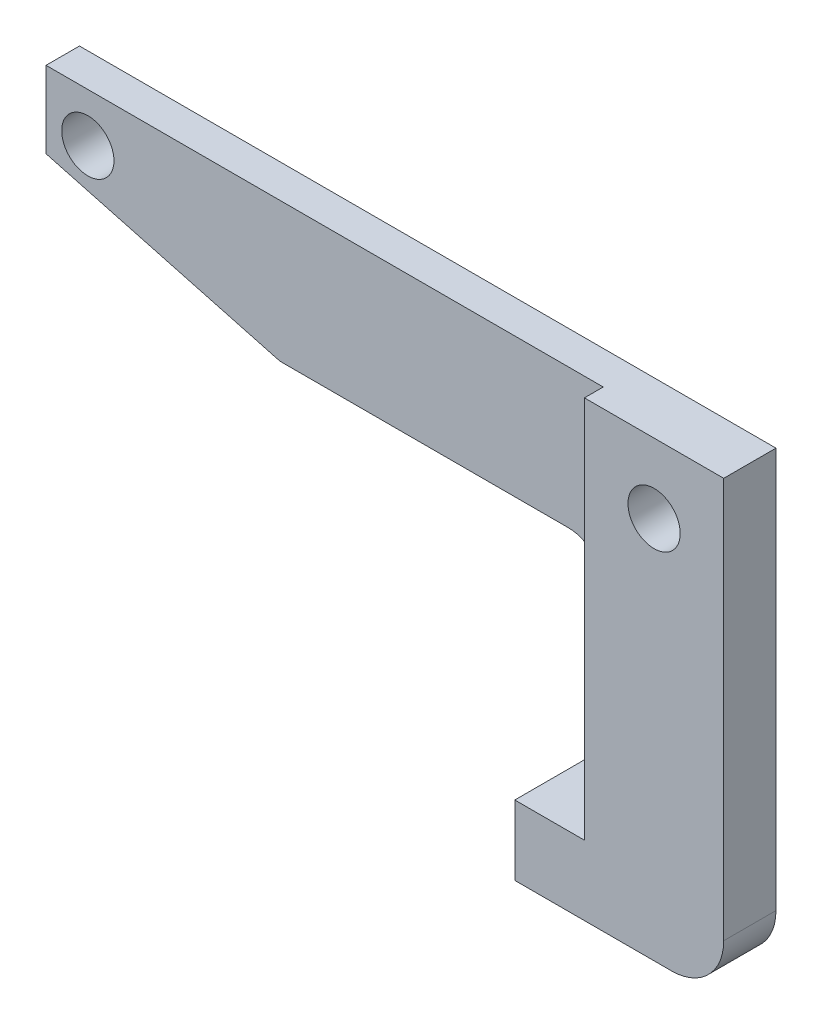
ISO-10303-21;
HEADER;
FILE_DESCRIPTION(('STEP AP214'),'2;1');
FILE_NAME('part.step','',(''),(''),'','','');
FILE_SCHEMA(('AUTOMOTIVE_DESIGN { 1 0 10303 214 1 1 1 1 }'));
ENDSEC;
DATA;
#1=APPLICATION_CONTEXT('core data for automotive mechanical design processes');
#2=APPLICATION_PROTOCOL_DEFINITION('international standard','automotive_design',2000,#1);
#3=PRODUCT_CONTEXT('',#1,'mechanical');
#4=PRODUCT('Part','Part','',(#3));
#5=PRODUCT_RELATED_PRODUCT_CATEGORY('part','',(#4));
#6=PRODUCT_DEFINITION_FORMATION('','',#4);
#7=PRODUCT_DEFINITION_CONTEXT('part definition',#1,'design');
#8=PRODUCT_DEFINITION('design','',#6,#7);
#9=PRODUCT_DEFINITION_SHAPE('','',#8);
#10=(LENGTH_UNIT() NAMED_UNIT(*) SI_UNIT(.MILLI.,.METRE.));
#11=(NAMED_UNIT(*) PLANE_ANGLE_UNIT() SI_UNIT($,.RADIAN.));
#12=(NAMED_UNIT(*) SI_UNIT($,.STERADIAN.) SOLID_ANGLE_UNIT());
#13=UNCERTAINTY_MEASURE_WITH_UNIT(LENGTH_MEASURE(1.E-05),#10,'distance_accuracy_value','');
#14=(GEOMETRIC_REPRESENTATION_CONTEXT(3) GLOBAL_UNCERTAINTY_ASSIGNED_CONTEXT((#13)) GLOBAL_UNIT_ASSIGNED_CONTEXT((#10,
#11,#12)) REPRESENTATION_CONTEXT('',''));
#15=CARTESIAN_POINT('',(0.,0.,0.));
#16=DIRECTION('',(0.,0.,1.));
#17=DIRECTION('',(1.,0.,0.));
#18=AXIS2_PLACEMENT_3D('',#15,#16,#17);
#19=CARTESIAN_POINT('',(12.7,-12.7,0.));
#20=DIRECTION('',(0.,0.,-1.));
#21=DIRECTION('',(-1.,0.,0.));
#22=AXIS2_PLACEMENT_3D('',#19,#20,#21);
#23=PLANE('',#22);
#24=CARTESIAN_POINT('',(0.,0.,0.));
#25=DIRECTION('',(0.,0.,-1.));
#26=DIRECTION('',(-1.,0.,0.));
#27=AXIS2_PLACEMENT_3D('',#24,#25,#26);
#28=CIRCLE('',#27,9.525);
#29=CARTESIAN_POINT('',(0.,9.52499999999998,0.));
#30=VERTEX_POINT('',#29);
#31=CARTESIAN_POINT('',(9.52499999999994,0.,0.));
#32=VERTEX_POINT('',#31);
#33=EDGE_CURVE('E49',#30,#32,#28,.T.);
#34=ORIENTED_EDGE('',*,*,#33,.F.);
#35=DIRECTION('',(1.,0.,0.));
#36=VECTOR('',#35,1.);
#37=CARTESIAN_POINT('',(9.52499999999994,9.52499999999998,0.));
#38=LINE('',#37,#36);
#39=CARTESIAN_POINT('',(9.52499999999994,9.52499999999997,0.));
#40=VERTEX_POINT('',#39);
#41=EDGE_CURVE('E150',#30,#40,#38,.T.);
#42=ORIENTED_EDGE('',*,*,#41,.T.);
#43=DIRECTION('',(0.,-1.,0.));
#44=VECTOR('',#43,1.);
#45=CARTESIAN_POINT('',(9.52499999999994,-12.7,0.));
#46=LINE('',#45,#44);
#47=EDGE_CURVE('E152',#40,#32,#46,.T.);
#48=ORIENTED_EDGE('',*,*,#47,.T.);
#49=EDGE_LOOP('',(#34,#42,#48));
#50=FACE_BOUND('',#49,.T.);
#51=ADVANCED_FACE('F34',(#50),#23,.T.);
#52=CARTESIAN_POINT('',(0.,0.,0.));
#53=DIRECTION('',(0.,0.,1.));
#54=DIRECTION('',(1.,0.,0.));
#55=AXIS2_PLACEMENT_3D('',#52,#53,#54);
#56=CYLINDRICAL_SURFACE('',#55,4.7625);
#57=CARTESIAN_POINT('',(0.,0.,12.7));
#58=DIRECTION('',(0.,0.,1.));
#59=DIRECTION('',(1.,0.,0.));
#60=AXIS2_PLACEMENT_3D('',#57,#58,#59);
#61=CIRCLE('',#60,4.7625);
#62=CARTESIAN_POINT('',(4.7625,0.,12.7));
#63=VERTEX_POINT('',#62);
#64=EDGE_CURVE('E208',#63,#63,#61,.T.);
#65=ORIENTED_EDGE('',*,*,#64,.T.);
#66=EDGE_LOOP('',(#65));
#67=FACE_BOUND('',#66,.T.);
#68=CARTESIAN_POINT('',(0.,0.,4.7752));
#69=DIRECTION('',(0.,0.,-1.));
#70=DIRECTION('',(-1.,0.,0.));
#71=AXIS2_PLACEMENT_3D('',#68,#69,#70);
#72=CIRCLE('',#71,4.7625);
#73=CARTESIAN_POINT('',(-4.7625,0.,4.7752));
#74=VERTEX_POINT('',#73);
#75=EDGE_CURVE('E38',#74,#74,#72,.F.);
#76=ORIENTED_EDGE('',*,*,#75,.F.);
#77=EDGE_LOOP('',(#76));
#78=FACE_BOUND('',#77,.T.);
#79=ADVANCED_FACE('F339',(#67,#78),#56,.F.);
#80=CARTESIAN_POINT('',(-114.3,-12.7,12.7));
#81=DIRECTION('',(0.,1.,0.));
#82=DIRECTION('',(-1.,0.,0.));
#83=AXIS2_PLACEMENT_3D('',#80,#81,#82);
#84=PLANE('',#83);
#85=DIRECTION('',(1.,0.,0.));
#86=VECTOR('',#85,1.);
#87=CARTESIAN_POINT('',(-114.3,-12.7,0.));
#88=LINE('',#87,#86);
#89=CARTESIAN_POINT('',(-71.6426592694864,-12.6999999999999,0.));
#90=VERTEX_POINT('',#89);
#91=CARTESIAN_POINT('',(-19.05,-12.7,0.));
#92=VERTEX_POINT('',#91);
#93=EDGE_CURVE('E184',#90,#92,#88,.T.);
#94=ORIENTED_EDGE('',*,*,#93,.T.);
#95=DIRECTION('',(0.,0.,-1.));
#96=VECTOR('',#95,1.);
#97=CARTESIAN_POINT('',(-19.05,-12.7,9.27099999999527));
#98=LINE('',#97,#96);
#99=CARTESIAN_POINT('',(-19.05,-12.7,9.27099999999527));
#100=VERTEX_POINT('',#99);
#101=EDGE_CURVE('E175',#92,#100,#98,.F.);
#102=ORIENTED_EDGE('',*,*,#101,.T.);
#103=DIRECTION('',(1.,0.,0.));
#104=VECTOR('',#103,1.);
#105=CARTESIAN_POINT('',(-114.3,-12.7,9.27099999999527));
#106=LINE('',#105,#104);
#107=CARTESIAN_POINT('',(-71.6426592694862,-12.7,9.27099999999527));
#108=VERTEX_POINT('',#107);
#109=EDGE_CURVE('E182',#108,#100,#106,.T.);
#110=ORIENTED_EDGE('',*,*,#109,.F.);
#111=DIRECTION('',(0.,0.,-1.));
#112=VECTOR('',#111,1.);
#113=CARTESIAN_POINT('',(-71.642659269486,-12.7,12.7));
#114=LINE('',#113,#112);
#115=EDGE_CURVE('E230',#108,#90,#114,.T.);
#116=ORIENTED_EDGE('',*,*,#115,.T.);
#117=EDGE_LOOP('',(#94,#102,#110,#116));
#118=FACE_BOUND('',#117,.T.);
#119=ADVANCED_FACE('F181',(#118),#84,.F.);
#120=CARTESIAN_POINT('',(12.7,12.7,12.7));
#121=DIRECTION('',(0.,-1.,0.));
#122=DIRECTION('',(1.,0.,0.));
#123=AXIS2_PLACEMENT_3D('',#120,#121,#122);
#124=PLANE('',#123);
#125=DIRECTION('',(0.,0.,-1.));
#126=VECTOR('',#125,1.);
#127=CARTESIAN_POINT('',(12.7,12.7,12.7));
#128=LINE('',#127,#126);
#129=CARTESIAN_POINT('',(12.7,12.7,12.7));
#130=VERTEX_POINT('',#129);
#131=CARTESIAN_POINT('',(12.7,12.7,3.17500000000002));
#132=VERTEX_POINT('',#131);
#133=EDGE_CURVE('E218',#130,#132,#128,.T.);
#134=ORIENTED_EDGE('',*,*,#133,.T.);
#135=DIRECTION('',(-1.,0.,0.));
#136=VECTOR('',#135,1.);
#137=CARTESIAN_POINT('',(-114.3,12.7,3.17500000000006));
#138=LINE('',#137,#136);
#139=CARTESIAN_POINT('',(-114.3,12.7,3.17500000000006));
#140=VERTEX_POINT('',#139);
#141=EDGE_CURVE('E261',#132,#140,#138,.T.);
#142=ORIENTED_EDGE('',*,*,#141,.T.);
#143=DIRECTION('',(0.,0.,-1.));
#144=VECTOR('',#143,1.);
#145=CARTESIAN_POINT('',(-114.3,12.7,12.7));
#146=LINE('',#145,#144);
#147=CARTESIAN_POINT('',(-114.3,12.7,9.27099999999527));
#148=VERTEX_POINT('',#147);
#149=EDGE_CURVE('E215',#148,#140,#146,.T.);
#150=ORIENTED_EDGE('',*,*,#149,.F.);
#151=DIRECTION('',(-1.,0.,0.));
#152=VECTOR('',#151,1.);
#153=CARTESIAN_POINT('',(-12.7,12.7,9.27099999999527));
#154=LINE('',#153,#152);
#155=CARTESIAN_POINT('',(-12.7,12.7,9.27099999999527));
#156=VERTEX_POINT('',#155);
#157=EDGE_CURVE('E276',#156,#148,#154,.T.);
#158=ORIENTED_EDGE('',*,*,#157,.F.);
#159=DIRECTION('',(0.,0.,1.));
#160=VECTOR('',#159,1.);
#161=CARTESIAN_POINT('',(-12.7,12.7,9.27099999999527));
#162=LINE('',#161,#160);
#163=CARTESIAN_POINT('',(-12.7,12.7,12.6999999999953));
#164=VERTEX_POINT('',#163);
#165=EDGE_CURVE('E278',#156,#164,#162,.T.);
#166=ORIENTED_EDGE('',*,*,#165,.T.);
#167=DIRECTION('',(-1.,0.,0.));
#168=VECTOR('',#167,1.);
#169=CARTESIAN_POINT('',(12.7,12.7,12.7));
#170=LINE('',#169,#168);
#171=EDGE_CURVE('E219',#130,#164,#170,.T.);
#172=ORIENTED_EDGE('',*,*,#171,.F.);
#173=EDGE_LOOP('',(#134,#142,#150,#158,#166,#172));
#174=FACE_BOUND('',#173,.T.);
#175=ADVANCED_FACE('F274',(#174),#124,.F.);
#176=CARTESIAN_POINT('',(-114.3,12.7,12.7));
#177=DIRECTION('',(1.,0.,0.));
#178=DIRECTION('',(0.,0.,-1.));
#179=AXIS2_PLACEMENT_3D('',#176,#177,#178);
#180=PLANE('',#179);
#181=ORIENTED_EDGE('',*,*,#149,.T.);
#182=DIRECTION('',(0.,-0.707106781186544,-0.707106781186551));
#183=VECTOR('',#182,1.);
#184=CARTESIAN_POINT('',(-114.3,12.7,3.17500000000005));
#185=LINE('',#184,#183);
#186=CARTESIAN_POINT('',(-114.3,9.52499999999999,0.));
#187=VERTEX_POINT('',#186);
#188=EDGE_CURVE('E161',#140,#187,#185,.T.);
#189=ORIENTED_EDGE('',*,*,#188,.T.);
#190=DIRECTION('',(0.,-1.,0.));
#191=VECTOR('',#190,1.);
#192=CARTESIAN_POINT('',(-114.3,12.7,0.));
#193=LINE('',#192,#191);
#194=CARTESIAN_POINT('',(-114.3,-1.26999999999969,0.));
#195=VERTEX_POINT('',#194);
#196=EDGE_CURVE('E167',#187,#195,#193,.T.);
#197=ORIENTED_EDGE('',*,*,#196,.T.);
#198=DIRECTION('',(0.,0.,1.));
#199=VECTOR('',#198,1.);
#200=CARTESIAN_POINT('',(-114.3,-1.26999999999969,12.7));
#201=LINE('',#200,#199);
#202=CARTESIAN_POINT('',(-114.3,-1.26999999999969,9.27099999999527));
#203=VERTEX_POINT('',#202);
#204=EDGE_CURVE('E234',#195,#203,#201,.T.);
#205=ORIENTED_EDGE('',*,*,#204,.T.);
#206=DIRECTION('',(0.,1.,0.));
#207=VECTOR('',#206,1.);
#208=CARTESIAN_POINT('',(-114.3,-12.7,9.27099999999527));
#209=LINE('',#208,#207);
#210=EDGE_CURVE('E194',#203,#148,#209,.T.);
#211=ORIENTED_EDGE('',*,*,#210,.T.);
#212=EDGE_LOOP('',(#181,#189,#197,#205,#211));
#213=FACE_BOUND('',#212,.T.);
#214=ADVANCED_FACE('F271',(#213),#180,.F.);
#215=CARTESIAN_POINT('',(12.7,-12.7,12.7));
#216=DIRECTION('',(0.,0.,-1.));
#217=DIRECTION('',(-1.,0.,0.));
#218=AXIS2_PLACEMENT_3D('',#215,#216,#217);
#219=PLANE('',#218);
#220=ORIENTED_EDGE('',*,*,#64,.F.);
#221=EDGE_LOOP('',(#220));
#222=FACE_BOUND('',#221,.T.);
#223=DIRECTION('',(-1.,0.,0.));
#224=VECTOR('',#223,1.);
#225=CARTESIAN_POINT('',(12.7,-69.85,12.7));
#226=LINE('',#225,#224);
#227=CARTESIAN_POINT('',(3.17499999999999,-69.85,12.7));
#228=VERTEX_POINT('',#227);
#229=CARTESIAN_POINT('',(-25.4,-69.85,12.7));
#230=VERTEX_POINT('',#229);
#231=EDGE_CURVE('E299',#228,#230,#226,.T.);
#232=ORIENTED_EDGE('',*,*,#231,.F.);
#233=CARTESIAN_POINT('',(3.17499999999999,-60.325,12.7));
#234=DIRECTION('',(0.,0.,-1.));
#235=DIRECTION('',(-1.,0.,0.));
#236=AXIS2_PLACEMENT_3D('',#233,#234,#235);
#237=CIRCLE('',#236,9.525);
#238=CARTESIAN_POINT('',(12.7,-60.325,12.7));
#239=VERTEX_POINT('',#238);
#240=EDGE_CURVE('E243',#228,#239,#237,.F.);
#241=ORIENTED_EDGE('',*,*,#240,.T.);
#242=DIRECTION('',(0.,-1.,0.));
#243=VECTOR('',#242,1.);
#244=CARTESIAN_POINT('',(12.7,12.7,12.7));
#245=LINE('',#244,#243);
#246=EDGE_CURVE('E301',#130,#239,#245,.T.);
#247=ORIENTED_EDGE('',*,*,#246,.F.);
#248=ORIENTED_EDGE('',*,*,#171,.T.);
#249=DIRECTION('',(0.,-1.,0.));
#250=VECTOR('',#249,1.);
#251=CARTESIAN_POINT('',(-12.7,-12.7,12.7));
#252=LINE('',#251,#250);
#253=CARTESIAN_POINT('',(-12.7,-57.15,12.7));
#254=VERTEX_POINT('',#253);
#255=EDGE_CURVE('E214',#164,#254,#252,.T.);
#256=ORIENTED_EDGE('',*,*,#255,.T.);
#257=DIRECTION('',(1.,0.,0.));
#258=VECTOR('',#257,1.);
#259=CARTESIAN_POINT('',(-25.4,-57.15,12.7));
#260=LINE('',#259,#258);
#261=CARTESIAN_POINT('',(-25.4,-57.15,12.7));
#262=VERTEX_POINT('',#261);
#263=EDGE_CURVE('E293',#262,#254,#260,.T.);
#264=ORIENTED_EDGE('',*,*,#263,.F.);
#265=DIRECTION('',(0.,1.,0.));
#266=VECTOR('',#265,1.);
#267=CARTESIAN_POINT('',(-25.4,-69.85,12.7));
#268=LINE('',#267,#266);
#269=EDGE_CURVE('E296',#230,#262,#268,.T.);
#270=ORIENTED_EDGE('',*,*,#269,.F.);
#271=EDGE_LOOP('',(#232,#241,#247,#248,#256,#264,#270));
#272=FACE_BOUND('',#271,.T.);
#273=ADVANCED_FACE('F306',(#222,#272),#219,.F.);
#274=CARTESIAN_POINT('',(-106.68,3.81000000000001,0.));
#275=DIRECTION('',(0.,0.,1.));
#276=DIRECTION('',(1.,0.,0.));
#277=AXIS2_PLACEMENT_3D('',#274,#275,#276);
#278=CYLINDRICAL_SURFACE('',#277,4.7625);
#279=CARTESIAN_POINT('',(-106.68,3.81000000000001,0.));
#280=DIRECTION('',(0.,0.,1.));
#281=DIRECTION('',(1.,0.,0.));
#282=AXIS2_PLACEMENT_3D('',#279,#280,#281);
#283=CIRCLE('',#282,4.7625);
#284=CARTESIAN_POINT('',(-101.9175,3.81000000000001,0.));
#285=VERTEX_POINT('',#284);
#286=EDGE_CURVE('E287',#285,#285,#283,.T.);
#287=ORIENTED_EDGE('',*,*,#286,.F.);
#288=EDGE_LOOP('',(#287));
#289=FACE_BOUND('',#288,.T.);
#290=CARTESIAN_POINT('',(-106.68,3.81000000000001,9.27099999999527));
#291=DIRECTION('',(0.,0.,1.));
#292=DIRECTION('',(1.,0.,0.));
#293=AXIS2_PLACEMENT_3D('',#290,#291,#292);
#294=CIRCLE('',#293,4.7625);
#295=CARTESIAN_POINT('',(-101.9175,3.81000000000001,9.27099999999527));
#296=VERTEX_POINT('',#295);
#297=EDGE_CURVE('E281',#296,#296,#294,.F.);
#298=ORIENTED_EDGE('',*,*,#297,.F.);
#299=EDGE_LOOP('',(#298));
#300=FACE_BOUND('',#299,.T.);
#301=ADVANCED_FACE('F351',(#289,#300),#278,.F.);
#302=CARTESIAN_POINT('',(-71.642659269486,-12.7,12.7));
#303=DIRECTION('',(0.258819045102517,0.965925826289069,0.));
#304=DIRECTION('',(-0.965925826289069,0.258819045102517,0.));
#305=AXIS2_PLACEMENT_3D('',#302,#303,#304);
#306=PLANE('',#305);
#307=ORIENTED_EDGE('',*,*,#115,.F.);
#308=DIRECTION('',(0.965925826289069,-0.258819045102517,0.));
#309=VECTOR('',#308,1.);
#310=CARTESIAN_POINT('',(-71.642659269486,-12.7,9.27099999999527));
#311=LINE('',#310,#309);
#312=EDGE_CURVE('E193',#108,#203,#311,.F.);
#313=ORIENTED_EDGE('',*,*,#312,.T.);
#314=ORIENTED_EDGE('',*,*,#204,.F.);
#315=DIRECTION('',(0.965925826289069,-0.258819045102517,0.));
#316=VECTOR('',#315,1.);
#317=CARTESIAN_POINT('',(7.05011314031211,-33.7856648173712,0.));
#318=LINE('',#317,#316);
#319=EDGE_CURVE('E232',#90,#195,#318,.F.);
#320=ORIENTED_EDGE('',*,*,#319,.F.);
#321=EDGE_LOOP('',(#307,#313,#314,#320));
#322=FACE_BOUND('',#321,.T.);
#323=ADVANCED_FACE('F372',(#322),#306,.F.);
#324=CARTESIAN_POINT('',(-12.7,-12.7,12.7));
#325=DIRECTION('',(1.,0.,0.));
#326=DIRECTION('',(0.,1.,0.));
#327=AXIS2_PLACEMENT_3D('',#324,#325,#326);
#328=PLANE('',#327);
#329=DIRECTION('',(0.,-1.,0.));
#330=VECTOR('',#329,1.);
#331=CARTESIAN_POINT('',(-12.7,12.7,9.27099999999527));
#332=LINE('',#331,#330);
#333=CARTESIAN_POINT('',(-12.7,-19.05,9.27099999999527));
#334=VERTEX_POINT('',#333);
#335=EDGE_CURVE('E195',#156,#334,#332,.T.);
#336=ORIENTED_EDGE('',*,*,#335,.T.);
#337=DIRECTION('',(0.,0.,-1.));
#338=VECTOR('',#337,1.);
#339=CARTESIAN_POINT('',(-12.7,-19.05,0.));
#340=LINE('',#339,#338);
#341=CARTESIAN_POINT('',(-12.7,-19.05,0.));
#342=VERTEX_POINT('',#341);
#343=EDGE_CURVE('E168',#334,#342,#340,.T.);
#344=ORIENTED_EDGE('',*,*,#343,.T.);
#345=DIRECTION('',(0.,-1.,0.));
#346=VECTOR('',#345,1.);
#347=CARTESIAN_POINT('',(-12.7,-12.7,0.));
#348=LINE('',#347,#346);
#349=CARTESIAN_POINT('',(-12.7,-57.15,0.));
#350=VERTEX_POINT('',#349);
#351=EDGE_CURVE('E200',#342,#350,#348,.T.);
#352=ORIENTED_EDGE('',*,*,#351,.T.);
#353=DIRECTION('',(0.,0.,-1.));
#354=VECTOR('',#353,1.);
#355=CARTESIAN_POINT('',(-12.7,-57.15,12.7));
#356=LINE('',#355,#354);
#357=EDGE_CURVE('E228',#254,#350,#356,.T.);
#358=ORIENTED_EDGE('',*,*,#357,.F.);
#359=ORIENTED_EDGE('',*,*,#255,.F.);
#360=ORIENTED_EDGE('',*,*,#165,.F.);
#361=EDGE_LOOP('',(#336,#344,#352,#358,#359,#360));
#362=FACE_BOUND('',#361,.T.);
#363=ADVANCED_FACE('F198',(#362),#328,.F.);
#364=CARTESIAN_POINT('',(-25.4,-57.15,12.7));
#365=DIRECTION('',(0.,1.,0.));
#366=DIRECTION('',(-1.,0.,0.));
#367=AXIS2_PLACEMENT_3D('',#364,#365,#366);
#368=PLANE('',#367);
#369=DIRECTION('',(1.,0.,0.));
#370=VECTOR('',#369,1.);
#371=CARTESIAN_POINT('',(-25.4,-57.15,0.));
#372=LINE('',#371,#370);
#373=CARTESIAN_POINT('',(-25.4,-57.15,0.));
#374=VERTEX_POINT('',#373);
#375=EDGE_CURVE('E204',#374,#350,#372,.T.);
#376=ORIENTED_EDGE('',*,*,#375,.F.);
#377=DIRECTION('',(0.,0.,-1.));
#378=VECTOR('',#377,1.);
#379=CARTESIAN_POINT('',(-25.4,-57.15,12.7));
#380=LINE('',#379,#378);
#381=EDGE_CURVE('E225',#262,#374,#380,.T.);
#382=ORIENTED_EDGE('',*,*,#381,.F.);
#383=ORIENTED_EDGE('',*,*,#263,.T.);
#384=ORIENTED_EDGE('',*,*,#357,.T.);
#385=EDGE_LOOP('',(#376,#382,#383,#384));
#386=FACE_BOUND('',#385,.T.);
#387=ADVANCED_FACE('F328',(#386),#368,.T.);
#388=CARTESIAN_POINT('',(-25.4,-69.85,12.7));
#389=DIRECTION('',(-1.,0.,0.));
#390=DIRECTION('',(0.,-1.,0.));
#391=AXIS2_PLACEMENT_3D('',#388,#389,#390);
#392=PLANE('',#391);
#393=DIRECTION('',(0.,1.,0.));
#394=VECTOR('',#393,1.);
#395=CARTESIAN_POINT('',(-25.4,-69.85,0.));
#396=LINE('',#395,#394);
#397=CARTESIAN_POINT('',(-25.4,-66.6749999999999,0.));
#398=VERTEX_POINT('',#397);
#399=EDGE_CURVE('E206',#398,#374,#396,.T.);
#400=ORIENTED_EDGE('',*,*,#399,.F.);
#401=DIRECTION('',(0.,0.707106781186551,-0.707106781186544));
#402=VECTOR('',#401,1.);
#403=CARTESIAN_POINT('',(-25.4,-74.6125,7.93749999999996));
#404=LINE('',#403,#402);
#405=CARTESIAN_POINT('',(-25.4,-69.85,3.17500000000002));
#406=VERTEX_POINT('',#405);
#407=EDGE_CURVE('E252',#398,#406,#404,.F.);
#408=ORIENTED_EDGE('',*,*,#407,.T.);
#409=DIRECTION('',(0.,0.,-1.));
#410=VECTOR('',#409,1.);
#411=CARTESIAN_POINT('',(-25.4,-69.85,12.7));
#412=LINE('',#411,#410);
#413=EDGE_CURVE('E222',#230,#406,#412,.T.);
#414=ORIENTED_EDGE('',*,*,#413,.F.);
#415=ORIENTED_EDGE('',*,*,#269,.T.);
#416=ORIENTED_EDGE('',*,*,#381,.T.);
#417=EDGE_LOOP('',(#400,#408,#414,#415,#416));
#418=FACE_BOUND('',#417,.T.);
#419=ADVANCED_FACE('F324',(#418),#392,.T.);
#420=CARTESIAN_POINT('',(12.7,-69.85,12.7));
#421=DIRECTION('',(0.,-1.,0.));
#422=DIRECTION('',(0.,0.,-1.));
#423=AXIS2_PLACEMENT_3D('',#420,#421,#422);
#424=PLANE('',#423);
#425=ORIENTED_EDGE('',*,*,#413,.T.);
#426=DIRECTION('',(1.,0.,0.));
#427=VECTOR('',#426,1.);
#428=CARTESIAN_POINT('',(12.7,-69.85,3.17500000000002));
#429=LINE('',#428,#427);
#430=CARTESIAN_POINT('',(3.17499999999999,-69.85,3.17500000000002));
#431=VERTEX_POINT('',#430);
#432=EDGE_CURVE('E254',#406,#431,#429,.T.);
#433=ORIENTED_EDGE('',*,*,#432,.T.);
#434=DIRECTION('',(0.,0.,-1.));
#435=VECTOR('',#434,1.);
#436=CARTESIAN_POINT('',(3.17499999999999,-69.85,12.7));
#437=LINE('',#436,#435);
#438=EDGE_CURVE('E241',#431,#228,#437,.F.);
#439=ORIENTED_EDGE('',*,*,#438,.T.);
#440=ORIENTED_EDGE('',*,*,#231,.T.);
#441=EDGE_LOOP('',(#425,#433,#439,#440));
#442=FACE_BOUND('',#441,.T.);
#443=ADVANCED_FACE('F363',(#442),#424,.T.);
#444=CARTESIAN_POINT('',(12.7,12.7,12.7));
#445=DIRECTION('',(1.,0.,0.));
#446=DIRECTION('',(0.,1.,0.));
#447=AXIS2_PLACEMENT_3D('',#444,#445,#446);
#448=PLANE('',#447);
#449=DIRECTION('',(0.,0.,-1.));
#450=VECTOR('',#449,1.);
#451=CARTESIAN_POINT('',(12.7,-60.325,12.7));
#452=LINE('',#451,#450);
#453=CARTESIAN_POINT('',(12.7,-60.325,3.17500000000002));
#454=VERTEX_POINT('',#453);
#455=EDGE_CURVE('E238',#239,#454,#452,.T.);
#456=ORIENTED_EDGE('',*,*,#455,.T.);
#457=DIRECTION('',(0.,1.,0.));
#458=VECTOR('',#457,1.);
#459=CARTESIAN_POINT('',(12.7,12.7,3.17500000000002));
#460=LINE('',#459,#458);
#461=EDGE_CURVE('E258',#454,#132,#460,.T.);
#462=ORIENTED_EDGE('',*,*,#461,.T.);
#463=ORIENTED_EDGE('',*,*,#133,.F.);
#464=ORIENTED_EDGE('',*,*,#246,.T.);
#465=EDGE_LOOP('',(#456,#462,#463,#464));
#466=FACE_BOUND('',#465,.T.);
#467=ADVANCED_FACE('F309',(#466),#448,.T.);
#468=EDGE_CURVE('E142',#32,#30,#28,.T.);
#469=ORIENTED_EDGE('',*,*,#468,.F.);
#470=CARTESIAN_POINT('',(9.52499999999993,-60.325,0.));
#471=VERTEX_POINT('',#470);
#472=EDGE_CURVE('E245',#32,#471,#46,.T.);
#473=ORIENTED_EDGE('',*,*,#472,.T.);
#474=CARTESIAN_POINT('',(3.17499999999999,-60.325,0.));
#475=DIRECTION('',(0.,0.,-1.));
#476=DIRECTION('',(-1.,0.,0.));
#477=AXIS2_PLACEMENT_3D('',#474,#475,#476);
#478=CIRCLE('',#477,6.34999999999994);
#479=CARTESIAN_POINT('',(3.17499999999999,-66.6749999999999,0.));
#480=VERTEX_POINT('',#479);
#481=EDGE_CURVE('E247',#471,#480,#478,.T.);
#482=ORIENTED_EDGE('',*,*,#481,.T.);
#483=DIRECTION('',(-1.,0.,0.));
#484=VECTOR('',#483,1.);
#485=CARTESIAN_POINT('',(12.7,-66.6749999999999,0.));
#486=LINE('',#485,#484);
#487=EDGE_CURVE('E249',#480,#398,#486,.T.);
#488=ORIENTED_EDGE('',*,*,#487,.T.);
#489=ORIENTED_EDGE('',*,*,#399,.T.);
#490=ORIENTED_EDGE('',*,*,#375,.T.);
#491=ORIENTED_EDGE('',*,*,#351,.F.);
#492=CARTESIAN_POINT('',(-19.05,-19.05,0.));
#493=DIRECTION('',(0.,0.,-1.));
#494=DIRECTION('',(-1.,0.,0.));
#495=AXIS2_PLACEMENT_3D('',#492,#493,#494);
#496=CIRCLE('',#495,6.35);
#497=EDGE_CURVE('E43',#342,#92,#496,.F.);
#498=ORIENTED_EDGE('',*,*,#497,.T.);
#499=ORIENTED_EDGE('',*,*,#93,.F.);
#500=ORIENTED_EDGE('',*,*,#319,.T.);
#501=ORIENTED_EDGE('',*,*,#196,.F.);
#502=EDGE_CURVE('E158',#187,#30,#38,.T.);
#503=ORIENTED_EDGE('',*,*,#502,.T.);
#504=EDGE_LOOP('',(#469,#473,#482,#488,#489,#490,#491,#498,#499,#500,#501,#503));
#505=FACE_BOUND('',#504,.T.);
#506=ORIENTED_EDGE('',*,*,#286,.T.);
#507=EDGE_LOOP('',(#506));
#508=FACE_BOUND('',#507,.T.);
#509=ADVANCED_FACE('F164',(#505,#508),#23,.T.);
#510=CARTESIAN_POINT('',(-12.7,-12.7,9.27099999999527));
#511=DIRECTION('',(0.,0.,1.));
#512=DIRECTION('',(1.,0.,0.));
#513=AXIS2_PLACEMENT_3D('',#510,#511,#512);
#514=PLANE('',#513);
#515=ORIENTED_EDGE('',*,*,#109,.T.);
#516=CARTESIAN_POINT('',(-19.05,-19.05,9.27099999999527));
#517=DIRECTION('',(0.,0.,1.));
#518=DIRECTION('',(1.,0.,0.));
#519=AXIS2_PLACEMENT_3D('',#516,#517,#518);
#520=CIRCLE('',#519,6.35);
#521=EDGE_CURVE('E11',#100,#334,#520,.F.);
#522=ORIENTED_EDGE('',*,*,#521,.T.);
#523=ORIENTED_EDGE('',*,*,#335,.F.);
#524=ORIENTED_EDGE('',*,*,#157,.T.);
#525=ORIENTED_EDGE('',*,*,#210,.F.);
#526=ORIENTED_EDGE('',*,*,#312,.F.);
#527=EDGE_LOOP('',(#515,#522,#523,#524,#525,#526));
#528=FACE_BOUND('',#527,.T.);
#529=ORIENTED_EDGE('',*,*,#297,.T.);
#530=EDGE_LOOP('',(#529));
#531=FACE_BOUND('',#530,.T.);
#532=ADVANCED_FACE('F188',(#528,#531),#514,.T.);
#533=CARTESIAN_POINT('',(3.17499999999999,-60.325,12.7));
#534=DIRECTION('',(0.,0.,-1.));
#535=DIRECTION('',(-1.,0.,0.));
#536=AXIS2_PLACEMENT_3D('',#533,#534,#535);
#537=CYLINDRICAL_SURFACE('',#536,9.525);
#538=ORIENTED_EDGE('',*,*,#438,.F.);
#539=CARTESIAN_POINT('',(3.17499999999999,-60.325,3.17500000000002));
#540=DIRECTION('',(0.,0.,-1.));
#541=DIRECTION('',(-1.,0.,0.));
#542=AXIS2_PLACEMENT_3D('',#539,#540,#541);
#543=CIRCLE('',#542,9.525);
#544=EDGE_CURVE('E256',#431,#454,#543,.F.);
#545=ORIENTED_EDGE('',*,*,#544,.T.);
#546=ORIENTED_EDGE('',*,*,#455,.F.);
#547=ORIENTED_EDGE('',*,*,#240,.F.);
#548=EDGE_LOOP('',(#538,#545,#546,#547));
#549=FACE_BOUND('',#548,.T.);
#550=ADVANCED_FACE('F377',(#549),#537,.T.);
#551=CARTESIAN_POINT('',(9.52499999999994,-12.7,0.));
#552=DIRECTION('',(-0.707106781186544,0.,0.707106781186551));
#553=DIRECTION('',(0.707106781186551,0.,0.707106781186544));
#554=AXIS2_PLACEMENT_3D('',#551,#552,#553);
#555=PLANE('',#554);
#556=ORIENTED_EDGE('',*,*,#47,.F.);
#557=DIRECTION('',(-0.577350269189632,-0.57735026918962,-0.577350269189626));
#558=VECTOR('',#557,1.);
#559=CARTESIAN_POINT('',(2.11666666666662,2.11666666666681,-7.40833333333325));
#560=LINE('',#559,#558);
#561=EDGE_CURVE('E160',#40,#132,#560,.F.);
#562=ORIENTED_EDGE('',*,*,#561,.T.);
#563=ORIENTED_EDGE('',*,*,#461,.F.);
#564=DIRECTION('',(0.707106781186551,0.,0.707106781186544));
#565=VECTOR('',#564,1.);
#566=CARTESIAN_POINT('',(9.52499999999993,-60.325,0.));
#567=LINE('',#566,#565);
#568=EDGE_CURVE('E265',#471,#454,#567,.T.);
#569=ORIENTED_EDGE('',*,*,#568,.F.);
#570=ORIENTED_EDGE('',*,*,#472,.F.);
#571=EDGE_LOOP('',(#556,#562,#563,#569,#570));
#572=FACE_BOUND('',#571,.T.);
#573=ADVANCED_FACE('F314',(#572),#555,.F.);
#574=CARTESIAN_POINT('',(3.17499999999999,-60.325,0.));
#575=DIRECTION('',(0.,0.,1.));
#576=DIRECTION('',(1.,0.,0.));
#577=AXIS2_PLACEMENT_3D('',#574,#575,#576);
#578=CONICAL_SURFACE('',#577,6.34999999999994,0.785398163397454);
#579=ORIENTED_EDGE('',*,*,#568,.T.);
#580=ORIENTED_EDGE('',*,*,#544,.F.);
#581=DIRECTION('',(0.,-0.707106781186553,0.707106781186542));
#582=VECTOR('',#581,1.);
#583=CARTESIAN_POINT('',(3.17499999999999,-66.6749999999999,0.));
#584=LINE('',#583,#582);
#585=EDGE_CURVE('E262',#480,#431,#584,.T.);
#586=ORIENTED_EDGE('',*,*,#585,.F.);
#587=ORIENTED_EDGE('',*,*,#481,.F.);
#588=EDGE_LOOP('',(#579,#580,#586,#587));
#589=FACE_BOUND('',#588,.T.);
#590=ADVANCED_FACE('F318',(#589),#578,.T.);
#591=CARTESIAN_POINT('',(12.7,-66.6749999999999,0.));
#592=DIRECTION('',(0.,0.707106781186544,0.707106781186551));
#593=DIRECTION('',(0.,-0.707106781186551,0.707106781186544));
#594=AXIS2_PLACEMENT_3D('',#591,#592,#593);
#595=PLANE('',#594);
#596=ORIENTED_EDGE('',*,*,#585,.T.);
#597=ORIENTED_EDGE('',*,*,#432,.F.);
#598=ORIENTED_EDGE('',*,*,#407,.F.);
#599=ORIENTED_EDGE('',*,*,#487,.F.);
#600=EDGE_LOOP('',(#596,#597,#598,#599));
#601=FACE_BOUND('',#600,.T.);
#602=ADVANCED_FACE('F381',(#601),#595,.F.);
#603=CARTESIAN_POINT('',(12.7,12.7,3.17500000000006));
#604=DIRECTION('',(0.,0.707106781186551,-0.707106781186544));
#605=DIRECTION('',(0.,0.707106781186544,0.707106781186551));
#606=AXIS2_PLACEMENT_3D('',#603,#604,#605);
#607=PLANE('',#606);
#608=ORIENTED_EDGE('',*,*,#561,.F.);
#609=ORIENTED_EDGE('',*,*,#41,.F.);
#610=ORIENTED_EDGE('',*,*,#502,.F.);
#611=ORIENTED_EDGE('',*,*,#188,.F.);
#612=ORIENTED_EDGE('',*,*,#141,.F.);
#613=EDGE_LOOP('',(#608,#609,#610,#611,#612));
#614=FACE_BOUND('',#613,.T.);
#615=ADVANCED_FACE('F157',(#614),#607,.T.);
#616=CARTESIAN_POINT('',(-19.05,-19.05,12.7));
#617=DIRECTION('',(0.,0.,1.));
#618=DIRECTION('',(1.,0.,0.));
#619=AXIS2_PLACEMENT_3D('',#616,#617,#618);
#620=CYLINDRICAL_SURFACE('',#619,6.35);
#621=ORIENTED_EDGE('',*,*,#521,.F.);
#622=ORIENTED_EDGE('',*,*,#101,.F.);
#623=ORIENTED_EDGE('',*,*,#497,.F.);
#624=ORIENTED_EDGE('',*,*,#343,.F.);
#625=EDGE_LOOP('',(#621,#622,#623,#624));
#626=FACE_BOUND('',#625,.T.);
#627=ADVANCED_FACE('F36',(#626),#620,.F.);
#628=CARTESIAN_POINT('',(0.,0.,4.7752));
#629=DIRECTION('',(0.,0.,-1.));
#630=DIRECTION('',(-1.,0.,0.));
#631=AXIS2_PLACEMENT_3D('',#628,#629,#630);
#632=PLANE('',#631);
#633=CARTESIAN_POINT('',(0.,0.,4.7752));
#634=DIRECTION('',(0.,0.,-1.));
#635=DIRECTION('',(-1.,0.,0.));
#636=AXIS2_PLACEMENT_3D('',#633,#634,#635);
#637=CIRCLE('',#636,9.525);
#638=CARTESIAN_POINT('',(-9.525,0.,4.7752));
#639=VERTEX_POINT('',#638);
#640=EDGE_CURVE('E153',#639,#639,#637,.T.);
#641=ORIENTED_EDGE('',*,*,#640,.T.);
#642=EDGE_LOOP('',(#641));
#643=FACE_BOUND('',#642,.T.);
#644=ORIENTED_EDGE('',*,*,#75,.T.);
#645=EDGE_LOOP('',(#644));
#646=FACE_BOUND('',#645,.T.);
#647=ADVANCED_FACE('F337',(#643,#646),#632,.T.);
#648=CARTESIAN_POINT('',(0.,0.,4.7752));
#649=DIRECTION('',(0.,0.,-1.));
#650=DIRECTION('',(-1.,0.,0.));
#651=AXIS2_PLACEMENT_3D('',#648,#649,#650);
#652=CYLINDRICAL_SURFACE('',#651,9.525);
#653=ORIENTED_EDGE('',*,*,#640,.F.);
#654=EDGE_LOOP('',(#653));
#655=FACE_BOUND('',#654,.T.);
#656=ORIENTED_EDGE('',*,*,#33,.T.);
#657=ORIENTED_EDGE('',*,*,#468,.T.);
#658=EDGE_LOOP('',(#656,#657));
#659=FACE_BOUND('',#658,.T.);
#660=ADVANCED_FACE('F143',(#655,#659),#652,.F.);
#661=CLOSED_SHELL('',(#51,#79,#119,#175,#214,#273,#301,#323,#363,#387,#419,#443,#467,#509,#532,
#550,#573,#590,#602,#615,#627,#647,#660));
#662=MANIFOLD_SOLID_BREP('B2',#661);
#663=ADVANCED_BREP_SHAPE_REPRESENTATION('',(#18,#662),#14);
#664=SHAPE_DEFINITION_REPRESENTATION(#9,#663);
ENDSEC;
END-ISO-10303-21;
